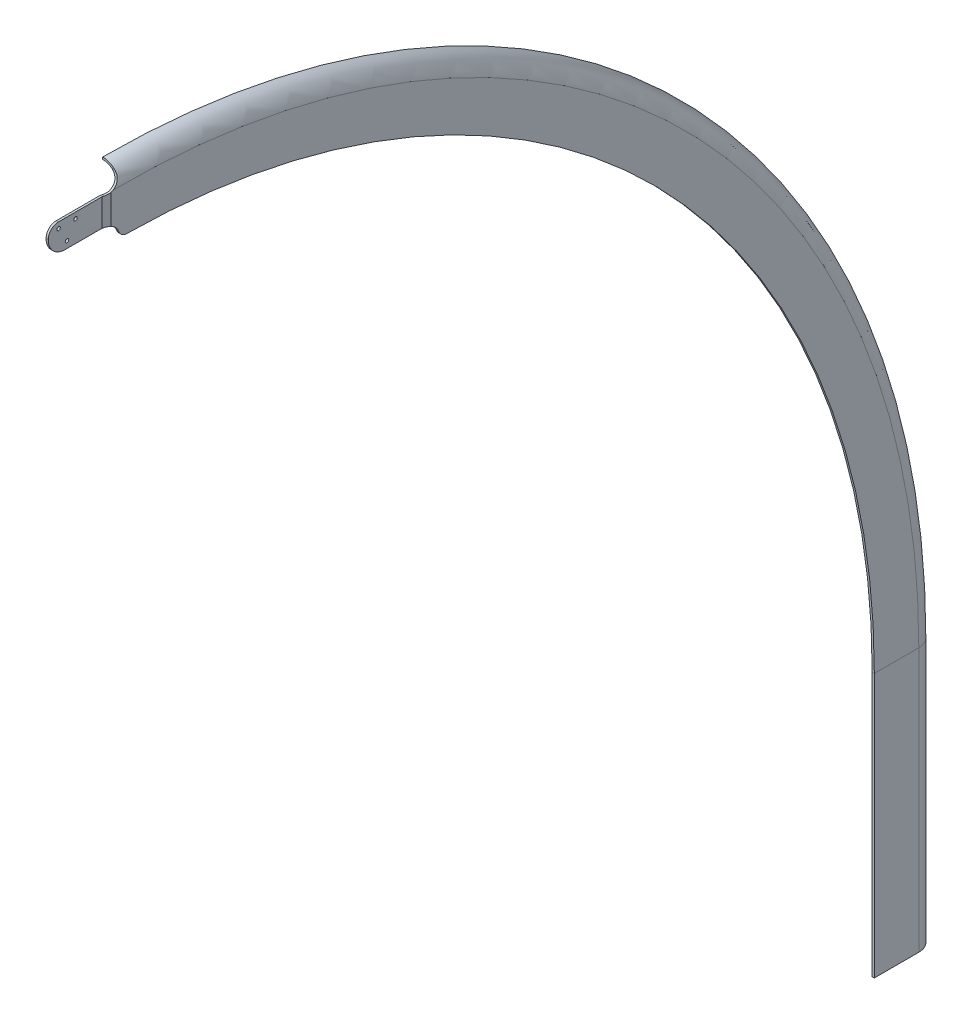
ISO-10303-21;
HEADER;
FILE_DESCRIPTION(('STEP AP214'),'2;1');
FILE_NAME('part.step','',(''),(''),'','','');
FILE_SCHEMA(('AUTOMOTIVE_DESIGN { 1 0 10303 214 1 1 1 1 }'));
ENDSEC;
DATA;
#1=APPLICATION_CONTEXT('core data for automotive mechanical design processes');
#2=APPLICATION_PROTOCOL_DEFINITION('international standard','automotive_design',2000,#1);
#3=PRODUCT_CONTEXT('',#1,'mechanical');
#4=PRODUCT('Part','Part','',(#3));
#5=PRODUCT_RELATED_PRODUCT_CATEGORY('part','',(#4));
#6=PRODUCT_DEFINITION_FORMATION('','',#4);
#7=PRODUCT_DEFINITION_CONTEXT('part definition',#1,'design');
#8=PRODUCT_DEFINITION('design','',#6,#7);
#9=PRODUCT_DEFINITION_SHAPE('','',#8);
#10=(LENGTH_UNIT() NAMED_UNIT(*) SI_UNIT(.MILLI.,.METRE.));
#11=(NAMED_UNIT(*) PLANE_ANGLE_UNIT() SI_UNIT($,.RADIAN.));
#12=(NAMED_UNIT(*) SI_UNIT($,.STERADIAN.) SOLID_ANGLE_UNIT());
#13=UNCERTAINTY_MEASURE_WITH_UNIT(LENGTH_MEASURE(1.E-05),#10,'distance_accuracy_value','');
#14=(GEOMETRIC_REPRESENTATION_CONTEXT(3) GLOBAL_UNCERTAINTY_ASSIGNED_CONTEXT((#13)) GLOBAL_UNIT_ASSIGNED_CONTEXT((#10,
#11,#12)) REPRESENTATION_CONTEXT('',''));
#15=CARTESIAN_POINT('',(0.,0.,0.));
#16=DIRECTION('',(0.,0.,1.));
#17=DIRECTION('',(1.,0.,0.));
#18=AXIS2_PLACEMENT_3D('',#15,#16,#17);
#19=CARTESIAN_POINT('',(0.,-844.7111,-645.3375));
#20=DIRECTION('',(-1.,0.,0.));
#21=DIRECTION('',(0.,0.,1.));
#22=AXIS2_PLACEMENT_3D('',#19,#20,#21);
#23=PLANE('',#22);
#24=DIRECTION('',(0.,1.,0.));
#25=VECTOR('',#24,1.);
#26=CARTESIAN_POINT('',(0.,-844.7111,-648.5125));
#27=LINE('',#26,#25);
#28=CARTESIAN_POINT('',(0.,-787.7111,-648.5125));
#29=VERTEX_POINT('',#28);
#30=CARTESIAN_POINT('',(0.,-379.5689,-648.5125));
#31=VERTEX_POINT('',#30);
#32=EDGE_CURVE('E239',#29,#31,#27,.T.);
#33=ORIENTED_EDGE('',*,*,#32,.F.);
#34=DIRECTION('',(0.,0.,-1.));
#35=VECTOR('',#34,1.);
#36=CARTESIAN_POINT('',(0.,-787.7111,-645.3375));
#37=LINE('',#36,#35);
#38=CARTESIAN_POINT('',(0.,-787.7111,-645.3375));
#39=VERTEX_POINT('',#38);
#40=EDGE_CURVE('E217',#39,#29,#37,.T.);
#41=ORIENTED_EDGE('',*,*,#40,.F.);
#42=DIRECTION('',(0.,1.,0.));
#43=VECTOR('',#42,1.);
#44=CARTESIAN_POINT('',(0.,-844.7111,-645.3375));
#45=LINE('',#44,#43);
#46=CARTESIAN_POINT('',(0.,-379.5689,-645.3375));
#47=VERTEX_POINT('',#46);
#48=EDGE_CURVE('E226',#39,#47,#45,.T.);
#49=ORIENTED_EDGE('',*,*,#48,.T.);
#50=DIRECTION('',(0.,0.,1.));
#51=VECTOR('',#50,1.);
#52=CARTESIAN_POINT('',(0.,-379.5689,-645.3375));
#53=LINE('',#52,#51);
#54=EDGE_CURVE('E340',#31,#47,#53,.T.);
#55=ORIENTED_EDGE('',*,*,#54,.F.);
#56=EDGE_LOOP('',(#33,#41,#49,#55));
#57=FACE_BOUND('',#56,.T.);
#58=ADVANCED_FACE('F50',(#57),#23,.T.);
#59=CARTESIAN_POINT('',(0.,-844.7111,-623.1125));
#60=DIRECTION('',(0.,1.,0.));
#61=DIRECTION('',(0.,0.,1.));
#62=AXIS2_PLACEMENT_3D('',#59,#60,#61);
#63=CYLINDRICAL_SURFACE('',#62,22.225);
#64=CARTESIAN_POINT('',(0.,-787.7111,-623.1125));
#65=DIRECTION('',(0.,1.,0.));
#66=DIRECTION('',(0.,0.,-1.));
#67=AXIS2_PLACEMENT_3D('',#64,#65,#66);
#68=CIRCLE('',#67,22.2249999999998);
#69=CARTESIAN_POINT('',(2.38107475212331,-787.7111,-645.209583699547));
#70=VERTEX_POINT('',#69);
#71=EDGE_CURVE('E213',#70,#39,#68,.T.);
#72=ORIENTED_EDGE('',*,*,#71,.F.);
#73=CARTESIAN_POINT('',(2.38107475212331,-787.7111,-645.209583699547));
#74=CARTESIAN_POINT('',(2.52251814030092,-787.71111617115,-645.19435608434));
#75=CARTESIAN_POINT('',(2.66380092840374,-787.705098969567,-645.177745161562));
#76=CARTESIAN_POINT('',(2.94500152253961,-787.681195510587,-645.141969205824));
#77=CARTESIAN_POINT('',(3.08491963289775,-787.663311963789,-645.12280475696));
#78=CARTESIAN_POINT('',(3.36212994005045,-787.615921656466,-645.082168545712));
#79=CARTESIAN_POINT('',(3.49942690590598,-787.586438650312,-645.060701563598));
#80=CARTESIAN_POINT('',(3.77074601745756,-787.516144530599,-645.015719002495));
#81=CARTESIAN_POINT('',(3.90476805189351,-787.475333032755,-644.992203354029));
#82=CARTESIAN_POINT('',(4.16855670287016,-787.382762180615,-644.943481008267));
#83=CARTESIAN_POINT('',(4.29832623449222,-787.331010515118,-644.918275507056));
#84=CARTESIAN_POINT('',(4.55288971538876,-787.216951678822,-644.866550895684));
#85=CARTESIAN_POINT('',(4.67768178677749,-787.154640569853,-644.840031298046));
#86=CARTESIAN_POINT('',(5.04341991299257,-786.952494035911,-644.759132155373));
#87=CARTESIAN_POINT('',(5.27584176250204,-786.797405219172,-644.703390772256));
#88=CARTESIAN_POINT('',(5.7168203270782,-786.446607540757,-644.590901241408));
#89=CARTESIAN_POINT('',(5.9246916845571,-786.250033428,-644.534160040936));
#90=CARTESIAN_POINT('',(6.20931582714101,-785.930565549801,-644.452715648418));
#91=CARTESIAN_POINT('',(6.29965848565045,-785.819977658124,-644.426179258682));
#92=CARTESIAN_POINT('',(6.47072494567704,-785.591228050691,-644.374868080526));
#93=CARTESIAN_POINT('',(6.55145167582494,-785.473068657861,-644.350092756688));
#94=CARTESIAN_POINT('',(6.71428361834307,-785.211213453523,-644.299227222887));
#95=CARTESIAN_POINT('',(6.79469314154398,-785.066384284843,-644.27352033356));
#96=CARTESIAN_POINT('',(6.94089791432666,-784.769130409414,-644.226011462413));
#97=CARTESIAN_POINT('',(7.00670935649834,-784.616714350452,-644.204205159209));
#98=CARTESIAN_POINT('',(7.06482325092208,-784.4611,-644.184730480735));
#99=B_SPLINE_CURVE_WITH_KNOTS('',3,(#73,#74,#75,#76,#77,#78,#79,#80,#81,#82,#83,#84,#85,#86,#87,
#88,#89,#90,#91,#92,#93,#94,#95,#96,#97,#98),.UNSPECIFIED.,.F.,.F.,(4,2,2,2,2,2,2,2,2,2,2,2,4),
(0.,0.426631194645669,0.853164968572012,1.27882975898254,1.70450899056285,2.12989004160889,
2.55543009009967,3.40614669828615,4.27676146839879,4.712051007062,5.1472076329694,
5.64925708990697,6.15074684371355),.UNSPECIFIED.);
#100=CARTESIAN_POINT('',(7.06482325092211,-784.4611,-644.184730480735));
#101=VERTEX_POINT('',#100);
#102=EDGE_CURVE('E76',#70,#101,#99,.T.);
#103=ORIENTED_EDGE('',*,*,#102,.T.);
#104=CARTESIAN_POINT('',(6.25,-787.7111,-644.440606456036));
#105=CARTESIAN_POINT('',(6.276241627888,-787.516042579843,-644.432913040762));
#106=CARTESIAN_POINT('',(6.30631454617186,-787.321569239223,-644.424051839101));
#107=CARTESIAN_POINT('',(6.37405971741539,-786.934075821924,-644.403889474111));
#108=CARTESIAN_POINT('',(6.41173206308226,-786.741055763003,-644.392588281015));
#109=CARTESIAN_POINT('',(6.53604447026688,-786.164646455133,-644.35487081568));
#110=CARTESIAN_POINT('',(6.63398486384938,-785.783871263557,-644.324639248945));
#111=CARTESIAN_POINT('',(6.85919344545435,-785.031806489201,-644.252888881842));
#112=CARTESIAN_POINT('',(6.98649107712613,-784.660526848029,-644.211358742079));
#113=CARTESIAN_POINT('',(7.26913274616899,-783.930482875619,-644.115656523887));
#114=CARTESIAN_POINT('',(7.42447516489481,-783.571717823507,-644.061485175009));
#115=CARTESIAN_POINT('',(7.76189541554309,-782.868706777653,-643.938826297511));
#116=CARTESIAN_POINT('',(7.94402105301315,-782.524488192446,-643.870313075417));
#117=CARTESIAN_POINT('',(8.33273349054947,-781.853839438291,-643.717348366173));
#118=CARTESIAN_POINT('',(8.5393207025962,-781.527409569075,-643.632896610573));
#119=CARTESIAN_POINT('',(8.9741282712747,-780.895189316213,-643.446498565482));
#120=CARTESIAN_POINT('',(9.20232126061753,-780.589373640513,-643.344574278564));
#121=CARTESIAN_POINT('',(9.67751511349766,-780.00014114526,-643.121626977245));
#122=CARTESIAN_POINT('',(9.92451518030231,-779.716723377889,-643.000604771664));
#123=CARTESIAN_POINT('',(10.4258523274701,-779.182604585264,-642.742304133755));
#124=CARTESIAN_POINT('',(10.6797180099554,-778.931157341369,-642.605652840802));
#125=CARTESIAN_POINT('',(11.1982981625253,-778.452219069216,-642.312433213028));
#126=CARTESIAN_POINT('',(11.46301235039,-778.224727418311,-642.155865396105));
#127=CARTESIAN_POINT('',(11.999601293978,-777.79437504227,-641.822389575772));
#128=CARTESIAN_POINT('',(12.2714768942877,-777.591517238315,-641.645479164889));
#129=CARTESIAN_POINT('',(12.8185857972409,-777.210583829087,-641.271362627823));
#130=CARTESIAN_POINT('',(13.0938191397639,-777.032508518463,-641.07415626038));
#131=CARTESIAN_POINT('',(13.6414653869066,-776.702193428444,-640.661786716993));
#132=CARTESIAN_POINT('',(13.9138811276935,-776.549732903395,-640.44680364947));
#133=CARTESIAN_POINT('',(14.4550883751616,-776.267719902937,-639.998133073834));
#134=CARTESIAN_POINT('',(14.7238799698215,-776.138166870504,-639.764446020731));
#135=CARTESIAN_POINT('',(15.2550031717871,-775.900502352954,-639.279284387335));
#136=CARTESIAN_POINT('',(15.517331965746,-775.792400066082,-639.027802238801));
#137=CARTESIAN_POINT('',(16.0328943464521,-775.595949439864,-638.508309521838));
#138=CARTESIAN_POINT('',(16.2861261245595,-775.507605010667,-638.240295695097));
#139=CARTESIAN_POINT('',(16.873314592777,-775.319219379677,-637.586609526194));
#140=CARTESIAN_POINT('',(17.2023260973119,-775.227018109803,-637.194205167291));
#141=CARTESIAN_POINT('',(17.8348636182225,-775.070746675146,-636.384000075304));
#142=CARTESIAN_POINT('',(18.1383796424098,-775.006687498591,-635.966189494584));
#143=CARTESIAN_POINT('',(18.7170544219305,-774.901260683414,-635.107944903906));
#144=CARTESIAN_POINT('',(18.9921774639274,-774.859921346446,-634.667483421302));
#145=CARTESIAN_POINT('',(19.5112646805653,-774.794900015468,-633.767591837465));
#146=CARTESIAN_POINT('',(19.7552393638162,-774.771212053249,-633.308168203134));
#147=CARTESIAN_POINT('',(20.2034751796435,-774.737252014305,-632.387422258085));
#148=CARTESIAN_POINT('',(20.4087320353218,-774.72658726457,-631.926599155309));
#149=CARTESIAN_POINT('',(20.692349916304,-774.716789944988,-631.226706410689));
#150=CARTESIAN_POINT('',(20.7826831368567,-774.714555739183,-630.992457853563));
#151=CARTESIAN_POINT('',(20.9553805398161,-774.711713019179,-630.520986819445));
#152=CARTESIAN_POINT('',(21.0377433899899,-774.711104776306,-630.283763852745));
#153=CARTESIAN_POINT('',(21.1160687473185,-774.7111,-630.04519541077));
#154=B_SPLINE_CURVE_WITH_KNOTS('',3,(#104,#105,#106,#107,#108,#109,#110,#111,#112,#113,#114,
#115,#116,#117,#118,#119,#120,#121,#122,#123,#124,#125,#126,#127,#128,#129,#130,#131,#132,#133,
#134,#135,#136,#137,#138,#139,#140,#141,#142,#143,#144,#145,#146,#147,#148,#149,#150,#151,#152,
#153),.UNSPECIFIED.,.F.,.F.,(4,2,2,2,2,2,2,2,2,2,2,2,2,2,2,2,2,2,2,2,2,2,2,2,4),(0.,
0.590808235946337,1.18162367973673,2.36314339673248,3.54585330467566,4.72849497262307,
5.91327375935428,7.09807250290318,8.28139008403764,9.46465756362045,10.6109009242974,
11.7571144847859,12.9034638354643,14.0498268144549,15.1857381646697,16.3216218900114,
17.4579916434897,18.5945860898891,20.1532708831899,21.7125637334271,23.2737945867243,
24.8344973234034,26.3468777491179,27.0999675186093,27.8531829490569),.UNSPECIFIED.);
#155=CARTESIAN_POINT('',(21.1160687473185,-774.7111,-630.04519541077));
#156=VERTEX_POINT('',#155);
#157=EDGE_CURVE('E511',#101,#156,#154,.T.);
#158=ORIENTED_EDGE('',*,*,#157,.T.);
#159=CARTESIAN_POINT('',(0.,-774.7111,-623.1125));
#160=DIRECTION('',(0.,-1.,0.));
#161=DIRECTION('',(0.,0.,-1.));
#162=AXIS2_PLACEMENT_3D('',#159,#160,#161);
#163=CIRCLE('',#162,22.225);
#164=CARTESIAN_POINT('',(22.225,-774.7111,-623.1125));
#165=VERTEX_POINT('',#164);
#166=EDGE_CURVE('E255',#156,#165,#163,.T.);
#167=ORIENTED_EDGE('',*,*,#166,.T.);
#168=DIRECTION('',(0.,1.,0.));
#169=VECTOR('',#168,1.);
#170=CARTESIAN_POINT('',(22.225,-844.7111,-623.1125));
#171=LINE('',#170,#169);
#172=CARTESIAN_POINT('',(22.225,-379.5689,-623.1125));
#173=VERTEX_POINT('',#172);
#174=EDGE_CURVE('E322',#165,#173,#171,.T.);
#175=ORIENTED_EDGE('',*,*,#174,.T.);
#176=CARTESIAN_POINT('',(0.,-379.5689,-623.1125));
#177=DIRECTION('',(0.,-1.,0.));
#178=DIRECTION('',(0.,0.,-1.));
#179=AXIS2_PLACEMENT_3D('',#176,#177,#178);
#180=CIRCLE('',#179,22.225);
#181=EDGE_CURVE('E228',#47,#173,#180,.T.);
#182=ORIENTED_EDGE('',*,*,#181,.F.);
#183=ORIENTED_EDGE('',*,*,#48,.F.);
#184=EDGE_LOOP('',(#72,#103,#158,#167,#175,#182,#183));
#185=FACE_BOUND('',#184,.T.);
#186=ADVANCED_FACE('F227',(#185),#63,.F.);
#187=CARTESIAN_POINT('',(22.225,-844.7111,-623.1125));
#188=DIRECTION('',(-1.,0.,0.));
#189=DIRECTION('',(0.,0.,1.));
#190=AXIS2_PLACEMENT_3D('',#187,#188,#189);
#191=PLANE('',#190);
#192=ORIENTED_EDGE('',*,*,#174,.F.);
#193=DIRECTION('',(0.,0.,1.));
#194=VECTOR('',#193,1.);
#195=CARTESIAN_POINT('',(22.225,-774.7111,-623.1125));
#196=LINE('',#195,#194);
#197=CARTESIAN_POINT('',(22.225,-774.7111,-556.4375));
#198=VERTEX_POINT('',#197);
#199=EDGE_CURVE('E251',#165,#198,#196,.T.);
#200=ORIENTED_EDGE('',*,*,#199,.T.);
#201=DIRECTION('',(0.,1.,0.));
#202=VECTOR('',#201,1.);
#203=CARTESIAN_POINT('',(22.225,-844.7111,-556.4375));
#204=LINE('',#203,#202);
#205=CARTESIAN_POINT('',(22.225,-379.5689,-556.4375));
#206=VERTEX_POINT('',#205);
#207=EDGE_CURVE('E341',#198,#206,#204,.T.);
#208=ORIENTED_EDGE('',*,*,#207,.T.);
#209=DIRECTION('',(0.,0.,1.));
#210=VECTOR('',#209,1.);
#211=CARTESIAN_POINT('',(22.225,-379.5689,-623.1125));
#212=LINE('',#211,#210);
#213=EDGE_CURVE('E325',#173,#206,#212,.T.);
#214=ORIENTED_EDGE('',*,*,#213,.F.);
#215=EDGE_LOOP('',(#192,#200,#208,#214));
#216=FACE_BOUND('',#215,.T.);
#217=ADVANCED_FACE('F474',(#216),#191,.T.);
#218=CARTESIAN_POINT('',(22.225,-844.7111,-556.4375));
#219=DIRECTION('',(0.,0.,1.));
#220=DIRECTION('',(0.,-1.,0.));
#221=AXIS2_PLACEMENT_3D('',#218,#219,#220);
#222=PLANE('',#221);
#223=ORIENTED_EDGE('',*,*,#207,.F.);
#224=DIRECTION('',(1.,0.,0.));
#225=VECTOR('',#224,1.);
#226=CARTESIAN_POINT('',(22.225,-774.7111,-556.4375));
#227=LINE('',#226,#225);
#228=CARTESIAN_POINT('',(25.4,-774.7111,-556.4375));
#229=VERTEX_POINT('',#228);
#230=EDGE_CURVE('E249',#198,#229,#227,.T.);
#231=ORIENTED_EDGE('',*,*,#230,.T.);
#232=DIRECTION('',(0.,1.,0.));
#233=VECTOR('',#232,1.);
#234=CARTESIAN_POINT('',(25.4,-844.7111,-556.4375));
#235=LINE('',#234,#233);
#236=CARTESIAN_POINT('',(25.4,-379.5689,-556.4375));
#237=VERTEX_POINT('',#236);
#238=EDGE_CURVE('E355',#229,#237,#235,.T.);
#239=ORIENTED_EDGE('',*,*,#238,.T.);
#240=DIRECTION('',(1.,0.,0.));
#241=VECTOR('',#240,1.);
#242=CARTESIAN_POINT('',(22.225,-379.5689,-556.4375));
#243=LINE('',#242,#241);
#244=EDGE_CURVE('E342',#206,#237,#243,.T.);
#245=ORIENTED_EDGE('',*,*,#244,.F.);
#246=EDGE_LOOP('',(#223,#231,#239,#245));
#247=FACE_BOUND('',#246,.T.);
#248=ADVANCED_FACE('F473',(#247),#222,.T.);
#249=CARTESIAN_POINT('',(25.4,-844.7111,-623.1125));
#250=DIRECTION('',(1.,0.,0.));
#251=DIRECTION('',(0.,0.,-1.));
#252=AXIS2_PLACEMENT_3D('',#249,#250,#251);
#253=PLANE('',#252);
#254=ORIENTED_EDGE('',*,*,#238,.F.);
#255=DIRECTION('',(0.,0.,-1.));
#256=VECTOR('',#255,1.);
#257=CARTESIAN_POINT('',(25.4,-774.7111,-623.1125));
#258=LINE('',#257,#256);
#259=CARTESIAN_POINT('',(25.4,-774.7111,-623.1125));
#260=VERTEX_POINT('',#259);
#261=EDGE_CURVE('E241',#229,#260,#258,.T.);
#262=ORIENTED_EDGE('',*,*,#261,.T.);
#263=DIRECTION('',(0.,1.,0.));
#264=VECTOR('',#263,1.);
#265=CARTESIAN_POINT('',(25.4,-844.7111,-623.1125));
#266=LINE('',#265,#264);
#267=CARTESIAN_POINT('',(25.4,-379.5689,-623.1125));
#268=VERTEX_POINT('',#267);
#269=EDGE_CURVE('E365',#260,#268,#266,.T.);
#270=ORIENTED_EDGE('',*,*,#269,.T.);
#271=DIRECTION('',(0.,0.,-1.));
#272=VECTOR('',#271,1.);
#273=CARTESIAN_POINT('',(25.4,-379.5689,-623.1125));
#274=LINE('',#273,#272);
#275=EDGE_CURVE('E354',#237,#268,#274,.T.);
#276=ORIENTED_EDGE('',*,*,#275,.F.);
#277=EDGE_LOOP('',(#254,#262,#270,#276));
#278=FACE_BOUND('',#277,.T.);
#279=ADVANCED_FACE('F484',(#278),#253,.T.);
#280=CARTESIAN_POINT('',(0.,-844.7111,-623.1125));
#281=DIRECTION('',(0.,1.,0.));
#282=DIRECTION('',(0.,0.,1.));
#283=AXIS2_PLACEMENT_3D('',#280,#281,#282);
#284=CYLINDRICAL_SURFACE('',#283,25.4);
#285=CARTESIAN_POINT('',(21.1160687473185,-774.7111,-637.228860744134));
#286=CARTESIAN_POINT('',(20.9683340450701,-774.711103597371,-637.449851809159));
#287=CARTESIAN_POINT('',(20.8171384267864,-774.713282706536,-637.66850764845));
#288=CARTESIAN_POINT('',(20.5079926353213,-774.722631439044,-638.100925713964));
#289=CARTESIAN_POINT('',(20.3500415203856,-774.729801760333,-638.314687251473));
#290=CARTESIAN_POINT('',(19.8659220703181,-774.75978597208,-638.948789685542));
#291=CARTESIAN_POINT('',(19.5298986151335,-774.79107667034,-639.361333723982));
#292=CARTESIAN_POINT('',(18.8319795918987,-774.881819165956,-640.165412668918));
#293=CARTESIAN_POINT('',(18.4699305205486,-774.941452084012,-640.556794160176));
#294=CARTESIAN_POINT('',(17.7256428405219,-775.094358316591,-641.312566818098));
#295=CARTESIAN_POINT('',(17.3434186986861,-775.187607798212,-641.676976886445));
#296=CARTESIAN_POINT('',(16.6457473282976,-775.389129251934,-642.302343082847));
#297=CARTESIAN_POINT('',(16.3332078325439,-775.490091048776,-642.568914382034));
#298=CARTESIAN_POINT('',(15.7014666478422,-775.718428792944,-643.082214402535));
#299=CARTESIAN_POINT('',(15.3822650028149,-775.845804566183,-643.32894325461));
#300=CARTESIAN_POINT('',(14.7418309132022,-776.128347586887,-643.800565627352));
#301=CARTESIAN_POINT('',(14.420608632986,-776.283421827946,-644.025528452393));
#302=CARTESIAN_POINT('',(13.7791050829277,-776.6229134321,-644.453656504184));
#303=CARTESIAN_POINT('',(13.458823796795,-776.807330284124,-644.65682211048));
#304=CARTESIAN_POINT('',(12.8216116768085,-777.207327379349,-645.042063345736));
#305=CARTESIAN_POINT('',(12.5047133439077,-777.423091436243,-645.224002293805));
#306=CARTESIAN_POINT('',(11.8808790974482,-777.884780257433,-645.565365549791));
#307=CARTESIAN_POINT('',(11.5739434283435,-778.130705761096,-645.724789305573));
#308=CARTESIAN_POINT('',(10.9743486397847,-778.652010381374,-646.021793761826));
#309=CARTESIAN_POINT('',(10.6817017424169,-778.927414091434,-646.159355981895));
#310=CARTESIAN_POINT('',(10.1152796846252,-779.505882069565,-646.4135195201));
#311=CARTESIAN_POINT('',(9.84150326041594,-779.808944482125,-646.530122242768));
#312=CARTESIAN_POINT('',(9.33851249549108,-780.414275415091,-646.734940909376));
#313=CARTESIAN_POINT('',(9.10748562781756,-780.714517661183,-646.824710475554));
#314=CARTESIAN_POINT('',(8.66714624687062,-781.334414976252,-646.989179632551));
#315=CARTESIAN_POINT('',(8.45783312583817,-781.654069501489,-647.063879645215));
#316=CARTESIAN_POINT('',(8.06315536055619,-782.310549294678,-647.199614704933));
#317=CARTESIAN_POINT('',(7.87778899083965,-782.647373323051,-647.260650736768));
#318=CARTESIAN_POINT('',(7.53282689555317,-783.335854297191,-647.370474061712));
#319=CARTESIAN_POINT('',(7.37322855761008,-783.687509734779,-647.419262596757));
#320=CARTESIAN_POINT('',(7.10784215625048,-784.338058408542,-647.498030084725));
#321=CARTESIAN_POINT('',(6.9975470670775,-784.634907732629,-647.529816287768));
#322=CARTESIAN_POINT('',(6.79581350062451,-785.235540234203,-647.586729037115));
#323=CARTESIAN_POINT('',(6.70437272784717,-785.539322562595,-647.611856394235));
#324=CARTESIAN_POINT('',(6.54096207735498,-786.152077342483,-647.655993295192));
#325=CARTESIAN_POINT('',(6.46896660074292,-786.461042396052,-647.675010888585));
#326=CARTESIAN_POINT('',(6.3446405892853,-787.083226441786,-647.707404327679));
#327=CARTESIAN_POINT('',(6.29231188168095,-787.39644582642,-647.720779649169));
#328=CARTESIAN_POINT('',(6.25,-787.7111,-647.731547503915));
#329=B_SPLINE_CURVE_WITH_KNOTS('',3,(#285,#286,#287,#288,#289,#290,#291,#292,#293,#294,#295,
#296,#297,#298,#299,#300,#301,#302,#303,#304,#305,#306,#307,#308,#309,#310,#311,#312,#313,#314,
#315,#316,#317,#318,#319,#320,#321,#322,#323,#324,#325,#326,#327,#328),.UNSPECIFIED.,.F.,.F.,(4,
2,2,2,2,2,2,2,2,2,2,2,2,2,2,2,2,2,2,2,2,4),(0.,0.797389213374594,1.59488995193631,
3.19210418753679,4.79966553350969,6.40608941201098,7.67388680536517,8.941675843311,
10.2052852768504,11.4688727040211,12.7401933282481,14.0115451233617,15.2839659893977,
16.5563015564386,17.7229210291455,18.8895078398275,20.0560105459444,21.2223949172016,
22.1765221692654,23.1305331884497,24.0832821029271,25.0361195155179),.UNSPECIFIED.);
#330=CARTESIAN_POINT('',(21.1160687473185,-774.7111,-637.228860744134));
#331=VERTEX_POINT('',#330);
#332=CARTESIAN_POINT('',(7.06482325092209,-784.4611,-647.510210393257));
#333=VERTEX_POINT('',#332);
#334=EDGE_CURVE('E503',#331,#333,#329,.T.);
#335=ORIENTED_EDGE('',*,*,#334,.T.);
#336=CARTESIAN_POINT('',(7.0648232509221,-784.4611,-647.510210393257));
#337=CARTESIAN_POINT('',(7.0152987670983,-784.59369074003,-647.524546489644));
#338=CARTESIAN_POINT('',(6.96017502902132,-784.724014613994,-647.540349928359));
#339=CARTESIAN_POINT('',(6.83926404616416,-784.979236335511,-647.574480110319));
#340=CARTESIAN_POINT('',(6.77347944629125,-785.104135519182,-647.592806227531));
#341=CARTESIAN_POINT('',(6.63186405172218,-785.347497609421,-647.631548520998));
#342=CARTESIAN_POINT('',(6.55604862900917,-785.465969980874,-647.651961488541));
#343=CARTESIAN_POINT('',(6.39487149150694,-785.695919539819,-647.694456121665));
#344=CARTESIAN_POINT('',(6.3095093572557,-785.807396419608,-647.716537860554));
#345=CARTESIAN_POINT('',(6.1299208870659,-786.022561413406,-647.761894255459));
#346=CARTESIAN_POINT('',(6.03570100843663,-786.126255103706,-647.785168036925));
#347=CARTESIAN_POINT('',(5.83895858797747,-786.325326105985,-647.832467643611));
#348=CARTESIAN_POINT('',(5.73643319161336,-786.420700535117,-647.856493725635));
#349=CARTESIAN_POINT('',(5.52376695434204,-786.602508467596,-647.90483529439));
#350=CARTESIAN_POINT('',(5.41362458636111,-786.688940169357,-647.92915083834));
#351=CARTESIAN_POINT('',(5.18645870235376,-786.852282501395,-647.977618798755));
#352=CARTESIAN_POINT('',(5.0694351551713,-786.929193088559,-648.001771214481));
#353=CARTESIAN_POINT('',(4.82700962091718,-787.074324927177,-648.049932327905));
#354=CARTESIAN_POINT('',(4.70149177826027,-787.142356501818,-648.073929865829));
#355=CARTESIAN_POINT('',(4.44498610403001,-787.26748304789,-648.120880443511));
#356=CARTESIAN_POINT('',(4.31400019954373,-787.324581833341,-648.143833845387));
#357=CARTESIAN_POINT('',(4.04748702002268,-787.427396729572,-648.188306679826));
#358=CARTESIAN_POINT('',(3.91196249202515,-787.473119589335,-648.20982695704));
#359=CARTESIAN_POINT('',(3.63729582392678,-787.55283095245,-648.251103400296));
#360=CARTESIAN_POINT('',(3.49815487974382,-787.586823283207,-648.270860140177));
#361=CARTESIAN_POINT('',(3.19723601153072,-787.64674684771,-648.310987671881));
#362=CARTESIAN_POINT('',(3.03504854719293,-787.670848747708,-648.331047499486));
#363=CARTESIAN_POINT('',(2.70898362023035,-787.703029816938,-648.368164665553));
#364=CARTESIAN_POINT('',(2.54510879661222,-787.711131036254,-648.385226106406));
#365=CARTESIAN_POINT('',(2.38107475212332,-787.7111,-648.400649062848));
#366=B_SPLINE_CURVE_WITH_KNOTS('',3,(#336,#337,#338,#339,#340,#341,#342,#343,#344,#345,#346,
#347,#348,#349,#350,#351,#352,#353,#354,#355,#356,#357,#358,#359,#360,#361,#362,#363,#364,#365),
.UNSPECIFIED.,.F.,.F.,(4,2,2,2,2,2,2,2,2,2,2,2,2,2,4),(0.,0.426629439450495,0.853153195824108,
1.2790307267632,1.70492697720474,2.13051512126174,2.5562501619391,2.9820708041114,
3.40789337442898,3.84168955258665,4.27533411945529,4.70872080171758,5.14196594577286,
5.6367132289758,6.1307782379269),.UNSPECIFIED.);
#367=CARTESIAN_POINT('',(2.38107475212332,-787.7111,-648.400649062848));
#368=VERTEX_POINT('',#367);
#369=EDGE_CURVE('E11',#333,#368,#366,.T.);
#370=ORIENTED_EDGE('',*,*,#369,.T.);
#371=CARTESIAN_POINT('',(0.,-787.7111,-623.1125));
#372=DIRECTION('',(0.,-1.,0.));
#373=DIRECTION('',(0.,0.,-1.));
#374=AXIS2_PLACEMENT_3D('',#371,#372,#373);
#375=CIRCLE('',#374,25.4);
#376=EDGE_CURVE('E240',#29,#368,#375,.T.);
#377=ORIENTED_EDGE('',*,*,#376,.F.);
#378=ORIENTED_EDGE('',*,*,#32,.T.);
#379=CARTESIAN_POINT('',(0.,-379.5689,-623.1125));
#380=DIRECTION('',(0.,1.,0.));
#381=DIRECTION('',(0.,0.,-1.));
#382=AXIS2_PLACEMENT_3D('',#379,#380,#381);
#383=CIRCLE('',#382,25.4);
#384=EDGE_CURVE('E366',#268,#31,#383,.T.);
#385=ORIENTED_EDGE('',*,*,#384,.F.);
#386=ORIENTED_EDGE('',*,*,#269,.F.);
#387=CARTESIAN_POINT('',(0.,-774.7111,-623.1125));
#388=DIRECTION('',(0.,-1.,0.));
#389=DIRECTION('',(0.,0.,-1.));
#390=AXIS2_PLACEMENT_3D('',#387,#388,#389);
#391=CIRCLE('',#390,25.4);
#392=EDGE_CURVE('E602',#260,#331,#391,.F.);
#393=ORIENTED_EDGE('',*,*,#392,.T.);
#394=EDGE_LOOP('',(#335,#370,#377,#378,#385,#386,#393));
#395=FACE_BOUND('',#394,.T.);
#396=ADVANCED_FACE('F483',(#395),#284,.T.);
#397=CARTESIAN_POINT('',(22.225,-379.5689,-623.1125));
#398=DIRECTION('',(-1.,0.,0.));
#399=DIRECTION('',(0.,0.,1.));
#400=AXIS2_PLACEMENT_3D('',#397,#398,#399);
#401=PLANE('',#400);
#402=CARTESIAN_POINT('',(22.225,-379.5689,574.18));
#403=DIRECTION('',(1.,0.,0.));
#404=DIRECTION('',(0.,0.,-1.));
#405=AXIS2_PLACEMENT_3D('',#402,#403,#404);
#406=CIRCLE('',#405,1130.6175);
#407=CARTESIAN_POINT('',(22.225,750.996154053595,563.290102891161));
#408=VERTEX_POINT('',#407);
#409=EDGE_CURVE('E331',#206,#408,#406,.T.);
#410=ORIENTED_EDGE('',*,*,#409,.T.);
#411=CARTESIAN_POINT('',(22.225,763.995551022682,563.164889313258));
#412=DIRECTION('',(-1.,0.,0.));
#413=DIRECTION('',(0.,0.,1.));
#414=AXIS2_PLACEMENT_3D('',#411,#412,#413);
#415=CIRCLE('',#414,13.);
#416=CARTESIAN_POINT('',(22.225,759.618775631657,575.405961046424));
#417=VERTEX_POINT('',#416);
#418=EDGE_CURVE('E596',#408,#417,#415,.T.);
#419=ORIENTED_EDGE('',*,*,#418,.T.);
#420=CARTESIAN_POINT('',(22.225,752.5486,595.18));
#421=DIRECTION('',(-1.,0.,0.));
#422=DIRECTION('',(0.,0.,1.));
#423=AXIS2_PLACEMENT_3D('',#420,#421,#422);
#424=CIRCLE('',#423,21.);
#425=CARTESIAN_POINT('',(22.225,771.787553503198,586.762003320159));
#426=VERTEX_POINT('',#425);
#427=EDGE_CURVE('E586',#417,#426,#424,.F.);
#428=ORIENTED_EDGE('',*,*,#427,.T.);
#429=DIRECTION('',(0.,-1.,0.));
#430=VECTOR('',#429,1.);
#431=CARTESIAN_POINT('',(22.225,814.5486,586.762003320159));
#432=LINE('',#431,#430);
#433=CARTESIAN_POINT('',(22.225,816.309646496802,586.762003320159));
#434=VERTEX_POINT('',#433);
#435=EDGE_CURVE('E234',#434,#426,#432,.T.);
#436=ORIENTED_EDGE('',*,*,#435,.F.);
#437=CARTESIAN_POINT('',(22.225,835.5486,595.18));
#438=DIRECTION('',(-1.,0.,0.));
#439=DIRECTION('',(0.,0.,1.));
#440=AXIS2_PLACEMENT_3D('',#437,#438,#439);
#441=CIRCLE('',#440,21.);
#442=CARTESIAN_POINT('',(22.225,817.68213709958,584.144171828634));
#443=VERTEX_POINT('',#442);
#444=EDGE_CURVE('E436',#434,#443,#441,.F.);
#445=ORIENTED_EDGE('',*,*,#444,.T.);
#446=CARTESIAN_POINT('',(22.225,-379.5689,574.18));
#447=DIRECTION('',(1.,0.,0.));
#448=DIRECTION('',(0.,0.,-1.));
#449=AXIS2_PLACEMENT_3D('',#446,#447,#448);
#450=CIRCLE('',#449,1197.2925);
#451=EDGE_CURVE('E328',#173,#443,#450,.T.);
#452=ORIENTED_EDGE('',*,*,#451,.F.);
#453=ORIENTED_EDGE('',*,*,#213,.T.);
#454=EDGE_LOOP('',(#410,#419,#428,#436,#445,#452,#453));
#455=FACE_BOUND('',#454,.T.);
#456=ADVANCED_FACE('F477',(#455),#401,.T.);
#457=CARTESIAN_POINT('',(22.225,814.5486,586.762003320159));
#458=DIRECTION('',(0.965925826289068,0.,0.258819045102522));
#459=DIRECTION('',(0.258819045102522,0.,-0.965925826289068));
#460=AXIS2_PLACEMENT_3D('',#457,#458,#459);
#461=PLANE('',#460);
#462=DIRECTION('',(0.258819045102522,0.,-0.965925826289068));
#463=VECTOR('',#462,1.);
#464=CARTESIAN_POINT('',(22.225,773.5486,586.762003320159));
#465=LINE('',#464,#463);
#466=CARTESIAN_POINT('',(19.3785501,773.5486,597.385098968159));
#467=VERTEX_POINT('',#466);
#468=CARTESIAN_POINT('',(19.9694045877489,773.5486,595.18));
#469=VERTEX_POINT('',#468);
#470=EDGE_CURVE('E278',#467,#469,#465,.T.);
#471=ORIENTED_EDGE('',*,*,#470,.F.);
#472=DIRECTION('',(0.,-1.,0.));
#473=VECTOR('',#472,1.);
#474=CARTESIAN_POINT('',(19.3785501,814.5486,597.385098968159));
#475=LINE('',#474,#473);
#476=CARTESIAN_POINT('',(19.3785501,814.5486,597.385098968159));
#477=VERTEX_POINT('',#476);
#478=EDGE_CURVE('E311',#477,#467,#475,.T.);
#479=ORIENTED_EDGE('',*,*,#478,.F.);
#480=DIRECTION('',(-0.258819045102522,0.,0.965925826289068));
#481=VECTOR('',#480,1.);
#482=CARTESIAN_POINT('',(22.225,814.5486,586.762003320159));
#483=LINE('',#482,#481);
#484=CARTESIAN_POINT('',(19.969404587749,814.5486,595.18));
#485=VERTEX_POINT('',#484);
#486=EDGE_CURVE('E284',#485,#477,#483,.T.);
#487=ORIENTED_EDGE('',*,*,#486,.F.);
#488=CARTESIAN_POINT('',(19.969404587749,835.5486,595.18));
#489=DIRECTION('',(0.965925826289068,0.,0.258819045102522));
#490=DIRECTION('',(0.258819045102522,0.,-0.965925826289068));
#491=AXIS2_PLACEMENT_3D('',#488,#489,#490);
#492=ELLIPSE('',#491,21.7407997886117,21.);
#493=EDGE_CURVE('E434',#485,#434,#492,.T.);
#494=ORIENTED_EDGE('',*,*,#493,.T.);
#495=ORIENTED_EDGE('',*,*,#435,.T.);
#496=CARTESIAN_POINT('',(19.9694045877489,752.5486,595.18));
#497=DIRECTION('',(0.965925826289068,0.,0.258819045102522));
#498=DIRECTION('',(0.258819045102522,0.,-0.965925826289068));
#499=AXIS2_PLACEMENT_3D('',#496,#497,#498);
#500=ELLIPSE('',#499,21.7407997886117,21.);
#501=EDGE_CURVE('E582',#426,#469,#500,.T.);
#502=ORIENTED_EDGE('',*,*,#501,.T.);
#503=EDGE_LOOP('',(#471,#479,#487,#494,#495,#502));
#504=FACE_BOUND('',#503,.T.);
#505=ADVANCED_FACE('F480',(#504),#461,.F.);
#506=CARTESIAN_POINT('',(19.3785501,814.5486,597.385098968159));
#507=DIRECTION('',(1.,0.,0.));
#508=DIRECTION('',(0.,0.,-1.));
#509=AXIS2_PLACEMENT_3D('',#506,#507,#508);
#510=PLANE('',#509);
#511=CARTESIAN_POINT('',(19.3785501,805.7236,662.800000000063));
#512=DIRECTION('',(-1.,0.,0.));
#513=DIRECTION('',(0.,0.,1.));
#514=AXIS2_PLACEMENT_3D('',#511,#512,#513);
#515=CIRCLE('',#514,2.59080000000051);
#516=CARTESIAN_POINT('',(19.3785501,805.7236,665.390800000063));
#517=VERTEX_POINT('',#516);
#518=EDGE_CURVE('E260',#517,#517,#515,.T.);
#519=ORIENTED_EDGE('',*,*,#518,.F.);
#520=EDGE_LOOP('',(#519));
#521=FACE_BOUND('',#520,.T.);
#522=CARTESIAN_POINT('',(19.3785501,805.7236,637.400000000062));
#523=DIRECTION('',(-1.,0.,0.));
#524=DIRECTION('',(0.,0.,1.));
#525=AXIS2_PLACEMENT_3D('',#522,#523,#524);
#526=CIRCLE('',#525,2.59079999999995);
#527=CARTESIAN_POINT('',(19.3785501,805.7236,639.990800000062));
#528=VERTEX_POINT('',#527);
#529=EDGE_CURVE('E264',#528,#528,#526,.T.);
#530=ORIENTED_EDGE('',*,*,#529,.F.);
#531=EDGE_LOOP('',(#530));
#532=FACE_BOUND('',#531,.T.);
#533=CARTESIAN_POINT('',(19.3785501,783.726554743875,650.100000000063));
#534=DIRECTION('',(-1.,0.,0.));
#535=DIRECTION('',(0.,0.,1.));
#536=AXIS2_PLACEMENT_3D('',#533,#534,#535);
#537=CIRCLE('',#536,2.59079999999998);
#538=CARTESIAN_POINT('',(19.3785501,783.726554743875,652.690800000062));
#539=VERTEX_POINT('',#538);
#540=EDGE_CURVE('E256',#539,#539,#537,.T.);
#541=ORIENTED_EDGE('',*,*,#540,.F.);
#542=EDGE_LOOP('',(#541));
#543=FACE_BOUND('',#542,.T.);
#544=DIRECTION('',(0.,0.,-1.));
#545=VECTOR('',#544,1.);
#546=CARTESIAN_POINT('',(19.3785501,773.5486,597.385098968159));
#547=LINE('',#546,#545);
#548=CARTESIAN_POINT('',(19.3785501,773.5486,653.248326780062));
#549=VERTEX_POINT('',#548);
#550=EDGE_CURVE('E274',#549,#467,#547,.T.);
#551=ORIENTED_EDGE('',*,*,#550,.F.);
#552=CARTESIAN_POINT('',(19.3785501,798.5486,653.248326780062));
#553=DIRECTION('',(1.,0.,0.));
#554=DIRECTION('',(0.,0.,-1.));
#555=AXIS2_PLACEMENT_3D('',#552,#553,#554);
#556=CIRCLE('',#555,25.);
#557=CARTESIAN_POINT('',(19.3785501,798.5486,678.248326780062));
#558=VERTEX_POINT('',#557);
#559=EDGE_CURVE('E420',#549,#558,#556,.F.);
#560=ORIENTED_EDGE('',*,*,#559,.T.);
#561=DIRECTION('',(0.,-1.,0.));
#562=VECTOR('',#561,1.);
#563=CARTESIAN_POINT('',(19.3785501,814.5486,678.248326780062));
#564=LINE('',#563,#562);
#565=CARTESIAN_POINT('',(19.3785501,799.5486,678.248326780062));
#566=VERTEX_POINT('',#565);
#567=EDGE_CURVE('E306',#566,#558,#564,.T.);
#568=ORIENTED_EDGE('',*,*,#567,.F.);
#569=CARTESIAN_POINT('',(19.3785501,799.5486,663.248326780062));
#570=DIRECTION('',(1.,0.,0.));
#571=DIRECTION('',(0.,0.,-1.));
#572=AXIS2_PLACEMENT_3D('',#569,#570,#571);
#573=CIRCLE('',#572,15.);
#574=CARTESIAN_POINT('',(19.3785501,814.5486,663.248326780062));
#575=VERTEX_POINT('',#574);
#576=EDGE_CURVE('E409',#566,#575,#573,.F.);
#577=ORIENTED_EDGE('',*,*,#576,.T.);
#578=DIRECTION('',(0.,0.,1.));
#579=VECTOR('',#578,1.);
#580=CARTESIAN_POINT('',(19.3785501,814.5486,597.385098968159));
#581=LINE('',#580,#579);
#582=EDGE_CURVE('E289',#477,#575,#581,.T.);
#583=ORIENTED_EDGE('',*,*,#582,.F.);
#584=ORIENTED_EDGE('',*,*,#478,.T.);
#585=EDGE_LOOP('',(#551,#560,#568,#577,#583,#584));
#586=FACE_BOUND('',#585,.T.);
#587=ADVANCED_FACE('F758',(#521,#532,#543,#586),#510,.F.);
#588=CARTESIAN_POINT('',(22.5535501,814.5486,678.248326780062));
#589=DIRECTION('',(0.,0.,-1.));
#590=DIRECTION('',(-1.,0.,0.));
#591=AXIS2_PLACEMENT_3D('',#588,#589,#590);
#592=PLANE('',#591);
#593=ORIENTED_EDGE('',*,*,#567,.T.);
#594=DIRECTION('',(-1.,0.,0.));
#595=VECTOR('',#594,1.);
#596=CARTESIAN_POINT('',(22.5535501,798.5486,678.248326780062));
#597=LINE('',#596,#595);
#598=CARTESIAN_POINT('',(22.5535501,798.5486,678.248326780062));
#599=VERTEX_POINT('',#598);
#600=EDGE_CURVE('E419',#558,#599,#597,.F.);
#601=ORIENTED_EDGE('',*,*,#600,.T.);
#602=DIRECTION('',(0.,-1.,0.));
#603=VECTOR('',#602,1.);
#604=CARTESIAN_POINT('',(22.5535501,814.5486,678.248326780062));
#605=LINE('',#604,#603);
#606=CARTESIAN_POINT('',(22.5535501,799.5486,678.248326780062));
#607=VERTEX_POINT('',#606);
#608=EDGE_CURVE('E303',#607,#599,#605,.T.);
#609=ORIENTED_EDGE('',*,*,#608,.F.);
#610=DIRECTION('',(1.,0.,0.));
#611=VECTOR('',#610,1.);
#612=CARTESIAN_POINT('',(19.3785501,799.5486,678.248326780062));
#613=LINE('',#612,#611);
#614=EDGE_CURVE('E407',#607,#566,#613,.F.);
#615=ORIENTED_EDGE('',*,*,#614,.T.);
#616=EDGE_LOOP('',(#593,#601,#609,#615));
#617=FACE_BOUND('',#616,.T.);
#618=ADVANCED_FACE('F772',(#617),#592,.F.);
#619=CARTESIAN_POINT('',(22.5535501,814.5486,597.803095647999));
#620=DIRECTION('',(-1.,0.,0.));
#621=DIRECTION('',(0.,0.,1.));
#622=AXIS2_PLACEMENT_3D('',#619,#620,#621);
#623=PLANE('',#622);
#624=CARTESIAN_POINT('',(22.5535501,805.7236,662.800000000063));
#625=DIRECTION('',(-1.,0.,0.));
#626=DIRECTION('',(0.,0.,1.));
#627=AXIS2_PLACEMENT_3D('',#624,#625,#626);
#628=CIRCLE('',#627,2.59080000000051);
#629=CARTESIAN_POINT('',(22.5535501,805.7236,665.390800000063));
#630=VERTEX_POINT('',#629);
#631=EDGE_CURVE('E276',#630,#630,#628,.T.);
#632=ORIENTED_EDGE('',*,*,#631,.T.);
#633=EDGE_LOOP('',(#632));
#634=FACE_BOUND('',#633,.T.);
#635=CARTESIAN_POINT('',(22.5535501,805.7236,637.400000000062));
#636=DIRECTION('',(-1.,0.,0.));
#637=DIRECTION('',(0.,0.,1.));
#638=AXIS2_PLACEMENT_3D('',#635,#636,#637);
#639=CIRCLE('',#638,2.59079999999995);
#640=CARTESIAN_POINT('',(22.5535501,805.7236,639.990800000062));
#641=VERTEX_POINT('',#640);
#642=EDGE_CURVE('E392',#641,#641,#639,.T.);
#643=ORIENTED_EDGE('',*,*,#642,.T.);
#644=EDGE_LOOP('',(#643));
#645=FACE_BOUND('',#644,.T.);
#646=CARTESIAN_POINT('',(22.5535501,783.726554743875,650.100000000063));
#647=DIRECTION('',(-1.,0.,0.));
#648=DIRECTION('',(0.,0.,1.));
#649=AXIS2_PLACEMENT_3D('',#646,#647,#648);
#650=CIRCLE('',#649,2.59079999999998);
#651=CARTESIAN_POINT('',(22.5535501,783.726554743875,652.690800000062));
#652=VERTEX_POINT('',#651);
#653=EDGE_CURVE('E261',#652,#652,#650,.T.);
#654=ORIENTED_EDGE('',*,*,#653,.T.);
#655=EDGE_LOOP('',(#654));
#656=FACE_BOUND('',#655,.T.);
#657=ORIENTED_EDGE('',*,*,#608,.T.);
#658=CARTESIAN_POINT('',(22.5535501,798.5486,653.248326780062));
#659=DIRECTION('',(-1.,0.,0.));
#660=DIRECTION('',(0.,0.,1.));
#661=AXIS2_PLACEMENT_3D('',#658,#659,#660);
#662=CIRCLE('',#661,25.);
#663=CARTESIAN_POINT('',(22.5535501,773.5486,653.248326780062));
#664=VERTEX_POINT('',#663);
#665=EDGE_CURVE('E423',#599,#664,#662,.F.);
#666=ORIENTED_EDGE('',*,*,#665,.T.);
#667=DIRECTION('',(0.,0.,1.));
#668=VECTOR('',#667,1.);
#669=CARTESIAN_POINT('',(22.5535501,773.5486,597.803095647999));
#670=LINE('',#669,#668);
#671=CARTESIAN_POINT('',(22.5535501,773.5486,597.803095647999));
#672=VERTEX_POINT('',#671);
#673=EDGE_CURVE('E271',#672,#664,#670,.T.);
#674=ORIENTED_EDGE('',*,*,#673,.F.);
#675=DIRECTION('',(0.,-1.,0.));
#676=VECTOR('',#675,1.);
#677=CARTESIAN_POINT('',(22.5535501,814.5486,597.803095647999));
#678=LINE('',#677,#676);
#679=CARTESIAN_POINT('',(22.5535501,814.5486,597.803095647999));
#680=VERTEX_POINT('',#679);
#681=EDGE_CURVE('E298',#680,#672,#678,.T.);
#682=ORIENTED_EDGE('',*,*,#681,.F.);
#683=DIRECTION('',(0.,0.,-1.));
#684=VECTOR('',#683,1.);
#685=CARTESIAN_POINT('',(22.5535501,814.5486,597.803095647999));
#686=LINE('',#685,#684);
#687=CARTESIAN_POINT('',(22.5535501,814.5486,663.248326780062));
#688=VERTEX_POINT('',#687);
#689=EDGE_CURVE('E287',#688,#680,#686,.T.);
#690=ORIENTED_EDGE('',*,*,#689,.F.);
#691=CARTESIAN_POINT('',(22.5535501,799.5486,663.248326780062));
#692=DIRECTION('',(-1.,0.,0.));
#693=DIRECTION('',(0.,0.,1.));
#694=AXIS2_PLACEMENT_3D('',#691,#692,#693);
#695=CIRCLE('',#694,15.);
#696=EDGE_CURVE('E403',#688,#607,#695,.F.);
#697=ORIENTED_EDGE('',*,*,#696,.T.);
#698=EDGE_LOOP('',(#657,#666,#674,#682,#690,#697));
#699=FACE_BOUND('',#698,.T.);
#700=ADVANCED_FACE('F563',(#634,#645,#656,#699),#623,.F.);
#701=CARTESIAN_POINT('',(25.4,814.5486,587.18));
#702=DIRECTION('',(-0.965925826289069,0.,-0.25881904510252));
#703=DIRECTION('',(-0.25881904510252,0.,0.965925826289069));
#704=AXIS2_PLACEMENT_3D('',#701,#702,#703);
#705=PLANE('',#704);
#706=DIRECTION('',(-0.25881904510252,0.,0.965925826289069));
#707=VECTOR('',#706,1.);
#708=CARTESIAN_POINT('',(25.4,773.5486,587.18));
#709=LINE('',#708,#707);
#710=CARTESIAN_POINT('',(23.256406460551,773.5486,595.18));
#711=VERTEX_POINT('',#710);
#712=EDGE_CURVE('E386',#711,#672,#709,.T.);
#713=ORIENTED_EDGE('',*,*,#712,.F.);
#714=CARTESIAN_POINT('',(23.256406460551,752.5486,595.18));
#715=DIRECTION('',(-0.965925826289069,0.,-0.25881904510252));
#716=DIRECTION('',(0.25881904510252,0.,-0.965925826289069));
#717=AXIS2_PLACEMENT_3D('',#714,#715,#716);
#718=ELLIPSE('',#717,21.7407997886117,21.);
#719=CARTESIAN_POINT('',(25.4,771.965087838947,587.18));
#720=VERTEX_POINT('',#719);
#721=EDGE_CURVE('E573',#711,#720,#718,.T.);
#722=ORIENTED_EDGE('',*,*,#721,.T.);
#723=DIRECTION('',(0.,-1.,0.));
#724=VECTOR('',#723,1.);
#725=CARTESIAN_POINT('',(25.4,814.5486,587.18));
#726=LINE('',#725,#724);
#727=CARTESIAN_POINT('',(25.4,816.132112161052,587.18));
#728=VERTEX_POINT('',#727);
#729=EDGE_CURVE('E299',#728,#720,#726,.T.);
#730=ORIENTED_EDGE('',*,*,#729,.F.);
#731=CARTESIAN_POINT('',(23.256406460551,835.5486,595.18));
#732=DIRECTION('',(-0.965925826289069,0.,-0.25881904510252));
#733=DIRECTION('',(0.25881904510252,0.,-0.965925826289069));
#734=AXIS2_PLACEMENT_3D('',#731,#732,#733);
#735=ELLIPSE('',#734,21.7407997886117,21.);
#736=CARTESIAN_POINT('',(23.256406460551,814.5486,595.18));
#737=VERTEX_POINT('',#736);
#738=EDGE_CURVE('E869',#728,#737,#735,.T.);
#739=ORIENTED_EDGE('',*,*,#738,.T.);
#740=DIRECTION('',(0.25881904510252,0.,-0.965925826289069));
#741=VECTOR('',#740,1.);
#742=CARTESIAN_POINT('',(25.4,814.5486,587.18));
#743=LINE('',#742,#741);
#744=EDGE_CURVE('E293',#680,#737,#743,.T.);
#745=ORIENTED_EDGE('',*,*,#744,.F.);
#746=ORIENTED_EDGE('',*,*,#681,.T.);
#747=EDGE_LOOP('',(#713,#722,#730,#739,#745,#746));
#748=FACE_BOUND('',#747,.T.);
#749=ADVANCED_FACE('F470',(#748),#705,.F.);
#750=CARTESIAN_POINT('',(0.,-379.5689,574.18));
#751=DIRECTION('',(1.,0.,0.));
#752=DIRECTION('',(0.,0.,-1.));
#753=AXIS2_PLACEMENT_3D('',#750,#751,#752);
#754=TOROIDAL_SURFACE('',#753,1197.2925,22.225);
#755=ORIENTED_EDGE('',*,*,#451,.T.);
#756=CARTESIAN_POINT('',(22.225,817.68213709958,584.144171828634));
#757=CARTESIAN_POINT('',(22.2249974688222,817.81682256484,583.926122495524));
#758=CARTESIAN_POINT('',(22.2238085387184,817.955488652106,583.710558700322));
#759=CARTESIAN_POINT('',(22.2186017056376,818.240607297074,583.284661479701));
#760=CARTESIAN_POINT('',(22.2145836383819,818.38706030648,583.074328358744));
#761=CARTESIAN_POINT('',(22.1975973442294,818.8379251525,582.451447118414));
#762=CARTESIAN_POINT('',(22.1796963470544,819.153742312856,582.047179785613));
#763=CARTESIAN_POINT('',(22.1268430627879,819.815209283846,581.261467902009));
#764=CARTESIAN_POINT('',(22.09180347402,820.161004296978,580.880151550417));
#765=CARTESIAN_POINT('',(22.0007860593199,820.878261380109,580.145217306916));
#766=CARTESIAN_POINT('',(21.944812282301,821.249718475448,579.791594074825));
#767=CARTESIAN_POINT('',(21.807882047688,822.01680533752,579.112826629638));
#768=CARTESIAN_POINT('',(21.7268057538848,822.412543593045,578.787828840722));
#769=CARTESIAN_POINT('',(21.5363395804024,823.222360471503,578.170502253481));
#770=CARTESIAN_POINT('',(21.4269482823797,823.636440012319,577.87817509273));
#771=CARTESIAN_POINT('',(21.1775081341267,824.476304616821,577.329089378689));
#772=CARTESIAN_POINT('',(21.0375802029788,824.902037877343,577.07219688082));
#773=CARTESIAN_POINT('',(20.7248110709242,825.761185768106,576.593762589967));
#774=CARTESIAN_POINT('',(20.5519733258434,826.194599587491,576.372217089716));
#775=CARTESIAN_POINT('',(20.188102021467,827.027097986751,575.98162572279));
#776=CARTESIAN_POINT('',(19.9997750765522,827.426041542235,575.809746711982));
#777=CARTESIAN_POINT('',(19.5944350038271,828.220873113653,575.495308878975));
#778=CARTESIAN_POINT('',(19.3774230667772,828.616761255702,575.352748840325));
#779=CARTESIAN_POINT('',(18.9144632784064,829.402395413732,575.095288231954));
#780=CARTESIAN_POINT('',(18.6684227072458,829.792116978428,574.980480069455));
#781=CARTESIAN_POINT('',(18.1490448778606,830.560031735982,574.777255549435));
#782=CARTESIAN_POINT('',(17.8757075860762,830.938224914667,574.688839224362));
#783=CARTESIAN_POINT('',(17.2826269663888,831.706159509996,574.530540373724));
#784=CARTESIAN_POINT('',(16.9609613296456,832.094783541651,574.462442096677));
#785=CARTESIAN_POINT('',(16.2899566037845,832.851170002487,574.350450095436));
#786=CARTESIAN_POINT('',(15.9406092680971,833.218926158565,574.306563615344));
#787=CARTESIAN_POINT('',(15.2180715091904,833.929041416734,574.239520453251));
#788=CARTESIAN_POINT('',(14.8449891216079,834.271502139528,574.216276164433));
#789=CARTESIAN_POINT('',(14.2684265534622,834.765510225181,574.193958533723));
#790=CARTESIAN_POINT('',(14.0734714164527,834.92685771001,574.188610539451));
#791=CARTESIAN_POINT('',(13.6781395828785,835.242821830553,574.181632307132));
#792=CARTESIAN_POINT('',(13.4777633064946,835.39743898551,574.180001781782));
#793=CARTESIAN_POINT('',(13.2747881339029,835.5486,574.18));
#794=B_SPLINE_CURVE_WITH_KNOTS('',3,(#756,#757,#758,#759,#760,#761,#762,#763,#764,#765,#766,
#767,#768,#769,#770,#771,#772,#773,#774,#775,#776,#777,#778,#779,#780,#781,#782,#783,#784,#785,
#786,#787,#788,#789,#790,#791,#792,#793),.UNSPECIFIED.,.F.,.F.,(4,2,2,2,2,2,2,2,2,2,2,2,2,2,2,2,
2,2,4),(0.,0.768782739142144,1.53761012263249,3.07583696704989,4.62198224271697,
6.16782863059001,7.721171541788,9.27459227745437,10.8219699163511,12.3691851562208,
13.7877940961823,15.2063441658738,16.6295545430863,18.0527666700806,19.5780612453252,
21.1038119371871,22.6230558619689,23.3822632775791,24.1414120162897),.UNSPECIFIED.);
#795=CARTESIAN_POINT('',(13.2747881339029,835.5486,574.18));
#796=VERTEX_POINT('',#795);
#797=EDGE_CURVE('E441',#443,#796,#794,.T.);
#798=ORIENTED_EDGE('',*,*,#797,.T.);
#799=CARTESIAN_POINT('',(0.,817.7236,574.18));
#800=DIRECTION('',(0.,0.,-1.));
#801=DIRECTION('',(0.,1.,0.));
#802=AXIS2_PLACEMENT_3D('',#799,#800,#801);
#803=CIRCLE('',#802,22.225);
#804=CARTESIAN_POINT('',(0.,839.9486,574.18));
#805=VERTEX_POINT('',#804);
#806=EDGE_CURVE('E323',#805,#796,#803,.T.);
#807=ORIENTED_EDGE('',*,*,#806,.F.);
#808=CARTESIAN_POINT('',(0.,-379.5689,574.18));
#809=DIRECTION('',(1.,0.,0.));
#810=DIRECTION('',(0.,0.,-1.));
#811=AXIS2_PLACEMENT_3D('',#808,#809,#810);
#812=CIRCLE('',#811,1219.5175);
#813=EDGE_CURVE('E330',#47,#805,#812,.T.);
#814=ORIENTED_EDGE('',*,*,#813,.F.);
#815=ORIENTED_EDGE('',*,*,#181,.T.);
#816=EDGE_LOOP('',(#755,#798,#807,#814,#815));
#817=FACE_BOUND('',#816,.T.);
#818=ADVANCED_FACE('F464',(#817),#754,.F.);
#819=CARTESIAN_POINT('',(0.,-379.5689,574.18));
#820=DIRECTION('',(1.,0.,0.));
#821=DIRECTION('',(0.,0.,-1.));
#822=AXIS2_PLACEMENT_3D('',#819,#820,#821);
#823=CYLINDRICAL_SURFACE('',#822,1130.6175);
#824=CARTESIAN_POINT('',(25.4,-379.5689,574.18));
#825=DIRECTION('',(1.,0.,0.));
#826=DIRECTION('',(0.,0.,-1.));
#827=AXIS2_PLACEMENT_3D('',#824,#825,#826);
#828=CIRCLE('',#827,1130.6175);
#829=CARTESIAN_POINT('',(25.4,750.996154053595,563.290102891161));
#830=VERTEX_POINT('',#829);
#831=EDGE_CURVE('E348',#237,#830,#828,.T.);
#832=ORIENTED_EDGE('',*,*,#831,.T.);
#833=DIRECTION('',(1.,0.,0.));
#834=VECTOR('',#833,1.);
#835=CARTESIAN_POINT('',(0.,750.996154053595,563.290102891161));
#836=LINE('',#835,#834);
#837=EDGE_CURVE('E597',#830,#408,#836,.F.);
#838=ORIENTED_EDGE('',*,*,#837,.T.);
#839=ORIENTED_EDGE('',*,*,#409,.F.);
#840=ORIENTED_EDGE('',*,*,#244,.T.);
#841=EDGE_LOOP('',(#832,#838,#839,#840));
#842=FACE_BOUND('',#841,.T.);
#843=ADVANCED_FACE('F466',(#842),#823,.F.);
#844=CARTESIAN_POINT('',(25.4,-379.5689,-623.1125));
#845=DIRECTION('',(1.,0.,0.));
#846=DIRECTION('',(0.,0.,-1.));
#847=AXIS2_PLACEMENT_3D('',#844,#845,#846);
#848=PLANE('',#847);
#849=CARTESIAN_POINT('',(25.4,752.5486,595.18));
#850=DIRECTION('',(1.,0.,0.));
#851=DIRECTION('',(0.,0.,-1.));
#852=AXIS2_PLACEMENT_3D('',#849,#850,#851);
#853=CIRCLE('',#852,21.);
#854=CARTESIAN_POINT('',(25.4,759.618775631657,575.405961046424));
#855=VERTEX_POINT('',#854);
#856=EDGE_CURVE('E578',#720,#855,#853,.F.);
#857=ORIENTED_EDGE('',*,*,#856,.T.);
#858=CARTESIAN_POINT('',(25.4,763.995551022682,563.164889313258));
#859=DIRECTION('',(1.,0.,0.));
#860=DIRECTION('',(0.,0.,-1.));
#861=AXIS2_PLACEMENT_3D('',#858,#859,#860);
#862=CIRCLE('',#861,13.);
#863=EDGE_CURVE('E593',#855,#830,#862,.T.);
#864=ORIENTED_EDGE('',*,*,#863,.T.);
#865=ORIENTED_EDGE('',*,*,#831,.F.);
#866=ORIENTED_EDGE('',*,*,#275,.T.);
#867=CARTESIAN_POINT('',(25.4,-379.5689,574.18));
#868=DIRECTION('',(1.,0.,0.));
#869=DIRECTION('',(0.,0.,-1.));
#870=AXIS2_PLACEMENT_3D('',#867,#868,#869);
#871=CIRCLE('',#870,1197.2925);
#872=CARTESIAN_POINT('',(25.4,817.68213709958,584.144171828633));
#873=VERTEX_POINT('',#872);
#874=EDGE_CURVE('E356',#268,#873,#871,.T.);
#875=ORIENTED_EDGE('',*,*,#874,.T.);
#876=CARTESIAN_POINT('',(25.4,835.5486,595.18));
#877=DIRECTION('',(1.,0.,0.));
#878=DIRECTION('',(0.,0.,-1.));
#879=AXIS2_PLACEMENT_3D('',#876,#877,#878);
#880=CIRCLE('',#879,21.);
#881=EDGE_CURVE('E870',#873,#728,#880,.F.);
#882=ORIENTED_EDGE('',*,*,#881,.T.);
#883=ORIENTED_EDGE('',*,*,#729,.T.);
#884=EDGE_LOOP('',(#857,#864,#865,#866,#875,#882,#883));
#885=FACE_BOUND('',#884,.T.);
#886=ADVANCED_FACE('F489',(#885),#848,.T.);
#887=CARTESIAN_POINT('',(0.,-379.5689,574.18));
#888=DIRECTION('',(1.,0.,0.));
#889=DIRECTION('',(0.,0.,-1.));
#890=AXIS2_PLACEMENT_3D('',#887,#888,#889);
#891=TOROIDAL_SURFACE('',#890,1197.2925,25.4);
#892=CARTESIAN_POINT('',(0.,-379.5689,574.18));
#893=DIRECTION('',(1.,0.,0.));
#894=DIRECTION('',(0.,0.,-1.));
#895=AXIS2_PLACEMENT_3D('',#892,#893,#894);
#896=CIRCLE('',#895,1222.6925);
#897=CARTESIAN_POINT('',(0.,843.1236,574.18));
#898=VERTEX_POINT('',#897);
#899=EDGE_CURVE('E377',#31,#898,#896,.T.);
#900=ORIENTED_EDGE('',*,*,#899,.T.);
#901=CARTESIAN_POINT('',(0.,817.7236,574.18));
#902=DIRECTION('',(0.,0.,1.));
#903=DIRECTION('',(0.,1.,0.));
#904=AXIS2_PLACEMENT_3D('',#901,#902,#903);
#905=CIRCLE('',#904,25.4);
#906=CARTESIAN_POINT('',(18.0950096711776,835.5486,574.18));
#907=VERTEX_POINT('',#906);
#908=EDGE_CURVE('E367',#907,#898,#905,.T.);
#909=ORIENTED_EDGE('',*,*,#908,.F.);
#910=CARTESIAN_POINT('',(18.0950096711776,835.5486,574.18));
#911=CARTESIAN_POINT('',(18.2794314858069,835.36138599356,574.180000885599));
#912=CARTESIAN_POINT('',(18.4609324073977,835.171321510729,574.182504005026));
#913=CARTESIAN_POINT('',(18.8178953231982,834.785717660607,574.192974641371));
#914=CARTESIAN_POINT('',(18.9933567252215,834.59017775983,574.200942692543));
#915=CARTESIAN_POINT('',(19.5105232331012,833.995520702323,574.233745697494));
#916=CARTESIAN_POINT('',(19.8428061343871,833.588573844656,574.267480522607));
#917=CARTESIAN_POINT('',(20.4810884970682,832.755593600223,574.362330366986));
#918=CARTESIAN_POINT('',(20.7870034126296,832.32950502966,574.423529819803));
#919=CARTESIAN_POINT('',(21.3695178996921,831.46311643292,574.576548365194));
#920=CARTESIAN_POINT('',(21.6461253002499,831.022820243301,574.668359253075));
#921=CARTESIAN_POINT('',(22.1700198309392,830.129832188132,574.885930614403));
#922=CARTESIAN_POINT('',(22.4171386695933,829.677085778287,575.011873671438));
#923=CARTESIAN_POINT('',(22.8793097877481,828.766538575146,575.299568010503));
#924=CARTESIAN_POINT('',(23.0943594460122,828.308737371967,575.461322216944));
#925=CARTESIAN_POINT('',(23.4915214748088,827.39491950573,575.821333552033));
#926=CARTESIAN_POINT('',(23.673724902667,826.938901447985,576.019486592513));
#927=CARTESIAN_POINT('',(24.0064752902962,826.033013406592,576.452863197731));
#928=CARTESIAN_POINT('',(24.1570250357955,825.583142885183,576.68808349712));
#929=CARTESIAN_POINT('',(24.4173572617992,824.729579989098,577.175244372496));
#930=CARTESIAN_POINT('',(24.5293994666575,824.325016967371,577.424462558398));
#931=CARTESIAN_POINT('',(24.7294889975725,823.529760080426,577.95283063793));
#932=CARTESIAN_POINT('',(24.8175366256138,823.139066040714,578.231980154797));
#933=CARTESIAN_POINT('',(24.9719623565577,822.374381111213,578.819288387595));
#934=CARTESIAN_POINT('',(25.0382967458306,822.000425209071,579.127504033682));
#935=CARTESIAN_POINT('',(25.1515920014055,821.273188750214,579.77064510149));
#936=CARTESIAN_POINT('',(25.1985546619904,820.91990628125,580.105568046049));
#937=CARTESIAN_POINT('',(25.2683031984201,820.303540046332,580.732103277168));
#938=CARTESIAN_POINT('',(25.2940220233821,820.036335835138,581.019362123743));
#939=CARTESIAN_POINT('',(25.3362046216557,819.518145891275,581.60876228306));
#940=CARTESIAN_POINT('',(25.3526692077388,819.267158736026,581.9109022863));
#941=CARTESIAN_POINT('',(25.3777843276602,818.783390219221,582.527700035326));
#942=CARTESIAN_POINT('',(25.3864667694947,818.550538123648,582.84230109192));
#943=CARTESIAN_POINT('',(25.3975699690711,818.102722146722,583.484076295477));
#944=CARTESIAN_POINT('',(25.3999910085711,817.887757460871,583.811249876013));
#945=CARTESIAN_POINT('',(25.4,817.68213709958,584.144171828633));
#946=B_SPLINE_CURVE_WITH_KNOTS('',3,(#910,#911,#912,#913,#914,#915,#916,#917,#918,#919,#920,
#921,#922,#923,#924,#925,#926,#927,#928,#929,#930,#931,#932,#933,#934,#935,#936,#937,#938,#939,
#940,#941,#942,#943,#944,#945),.UNSPECIFIED.,.F.,.F.,(4,2,2,2,2,2,2,2,2,2,2,2,2,2,2,2,2,4),(0.,
0.788293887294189,1.57666484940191,3.15427886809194,4.736776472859,6.31885026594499,
7.90956006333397,9.50039980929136,11.0867591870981,12.6729788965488,14.1358561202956,
15.598714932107,17.0645009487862,18.5301511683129,19.7089353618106,20.8876160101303,
22.0614414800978,23.2352141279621),.UNSPECIFIED.);
#947=EDGE_CURVE('E448',#907,#873,#946,.T.);
#948=ORIENTED_EDGE('',*,*,#947,.T.);
#949=ORIENTED_EDGE('',*,*,#874,.F.);
#950=ORIENTED_EDGE('',*,*,#384,.T.);
#951=EDGE_LOOP('',(#900,#909,#948,#949,#950));
#952=FACE_BOUND('',#951,.T.);
#953=ADVANCED_FACE('F494',(#952),#891,.T.);
#954=CARTESIAN_POINT('',(0.,-379.5689,-645.3375));
#955=DIRECTION('',(-1.,0.,0.));
#956=DIRECTION('',(0.,0.,1.));
#957=AXIS2_PLACEMENT_3D('',#954,#955,#956);
#958=PLANE('',#957);
#959=DIRECTION('',(0.,-1.,0.));
#960=VECTOR('',#959,1.);
#961=CARTESIAN_POINT('',(0.,839.9486,574.18));
#962=LINE('',#961,#960);
#963=EDGE_CURVE('E382',#898,#805,#962,.T.);
#964=ORIENTED_EDGE('',*,*,#963,.F.);
#965=ORIENTED_EDGE('',*,*,#899,.F.);
#966=ORIENTED_EDGE('',*,*,#54,.T.);
#967=ORIENTED_EDGE('',*,*,#813,.T.);
#968=EDGE_LOOP('',(#964,#965,#966,#967));
#969=FACE_BOUND('',#968,.T.);
#970=ADVANCED_FACE('F543',(#969),#958,.T.);
#971=CARTESIAN_POINT('',(25.4,710.739123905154,574.18));
#972=DIRECTION('',(0.,0.,1.));
#973=DIRECTION('',(1.,0.,0.));
#974=AXIS2_PLACEMENT_3D('',#971,#972,#973);
#975=PLANE('',#974);
#976=ORIENTED_EDGE('',*,*,#806,.T.);
#977=DIRECTION('',(-1.,0.,0.));
#978=VECTOR('',#977,1.);
#979=CARTESIAN_POINT('',(25.4,835.5486,574.18));
#980=LINE('',#979,#978);
#981=EDGE_CURVE('E429',#796,#907,#980,.F.);
#982=ORIENTED_EDGE('',*,*,#981,.T.);
#983=ORIENTED_EDGE('',*,*,#908,.T.);
#984=ORIENTED_EDGE('',*,*,#963,.T.);
#985=EDGE_LOOP('',(#976,#982,#983,#984));
#986=FACE_BOUND('',#985,.T.);
#987=ADVANCED_FACE('F467',(#986),#975,.T.);
#988=CARTESIAN_POINT('',(0.,814.5486,0.));
#989=DIRECTION('',(0.,1.,0.));
#990=DIRECTION('',(0.,0.,1.));
#991=AXIS2_PLACEMENT_3D('',#988,#989,#990);
#992=PLANE('',#991);
#993=ORIENTED_EDGE('',*,*,#744,.T.);
#994=DIRECTION('',(-1.,0.,0.));
#995=VECTOR('',#994,1.);
#996=CARTESIAN_POINT('',(22.225,814.5486,595.18));
#997=LINE('',#996,#995);
#998=EDGE_CURVE('E426',#737,#485,#997,.T.);
#999=ORIENTED_EDGE('',*,*,#998,.T.);
#1000=ORIENTED_EDGE('',*,*,#486,.T.);
#1001=ORIENTED_EDGE('',*,*,#582,.T.);
#1002=DIRECTION('',(1.,0.,0.));
#1003=VECTOR('',#1002,1.);
#1004=CARTESIAN_POINT('',(22.5535501,814.5486,663.248326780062));
#1005=LINE('',#1004,#1003);
#1006=EDGE_CURVE('E387',#575,#688,#1005,.T.);
#1007=ORIENTED_EDGE('',*,*,#1006,.T.);
#1008=ORIENTED_EDGE('',*,*,#689,.T.);
#1009=EDGE_LOOP('',(#993,#999,#1000,#1001,#1007,#1008));
#1010=FACE_BOUND('',#1009,.T.);
#1011=ADVANCED_FACE('F744',(#1010),#992,.T.);
#1012=CARTESIAN_POINT('',(25.4,773.5486,684.108906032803));
#1013=DIRECTION('',(0.,-1.,0.));
#1014=DIRECTION('',(0.,0.,-1.));
#1015=AXIS2_PLACEMENT_3D('',#1012,#1013,#1014);
#1016=PLANE('',#1015);
#1017=ORIENTED_EDGE('',*,*,#470,.T.);
#1018=DIRECTION('',(-1.,0.,0.));
#1019=VECTOR('',#1018,1.);
#1020=CARTESIAN_POINT('',(25.4,773.5486,595.18));
#1021=LINE('',#1020,#1019);
#1022=EDGE_CURVE('E567',#469,#711,#1021,.F.);
#1023=ORIENTED_EDGE('',*,*,#1022,.T.);
#1024=ORIENTED_EDGE('',*,*,#712,.T.);
#1025=ORIENTED_EDGE('',*,*,#673,.T.);
#1026=DIRECTION('',(-1.,0.,0.));
#1027=VECTOR('',#1026,1.);
#1028=CARTESIAN_POINT('',(19.3785501,773.5486,653.248326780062));
#1029=LINE('',#1028,#1027);
#1030=EDGE_CURVE('E411',#664,#549,#1029,.T.);
#1031=ORIENTED_EDGE('',*,*,#1030,.T.);
#1032=ORIENTED_EDGE('',*,*,#550,.T.);
#1033=EDGE_LOOP('',(#1017,#1023,#1024,#1025,#1031,#1032));
#1034=FACE_BOUND('',#1033,.T.);
#1035=ADVANCED_FACE('F562',(#1034),#1016,.T.);
#1036=CARTESIAN_POINT('',(25.4,783.726554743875,650.100000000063));
#1037=DIRECTION('',(-1.,0.,0.));
#1038=DIRECTION('',(0.,0.,1.));
#1039=AXIS2_PLACEMENT_3D('',#1036,#1037,#1038);
#1040=CYLINDRICAL_SURFACE('',#1039,2.59079999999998);
#1041=ORIENTED_EDGE('',*,*,#540,.T.);
#1042=EDGE_LOOP('',(#1041));
#1043=FACE_BOUND('',#1042,.T.);
#1044=ORIENTED_EDGE('',*,*,#653,.F.);
#1045=EDGE_LOOP('',(#1044));
#1046=FACE_BOUND('',#1045,.T.);
#1047=ADVANCED_FACE('F727',(#1043,#1046),#1040,.F.);
#1048=CARTESIAN_POINT('',(25.4,805.7236,637.400000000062));
#1049=DIRECTION('',(-1.,0.,0.));
#1050=DIRECTION('',(0.,0.,1.));
#1051=AXIS2_PLACEMENT_3D('',#1048,#1049,#1050);
#1052=CYLINDRICAL_SURFACE('',#1051,2.59079999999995);
#1053=ORIENTED_EDGE('',*,*,#529,.T.);
#1054=EDGE_LOOP('',(#1053));
#1055=FACE_BOUND('',#1054,.T.);
#1056=ORIENTED_EDGE('',*,*,#642,.F.);
#1057=EDGE_LOOP('',(#1056));
#1058=FACE_BOUND('',#1057,.T.);
#1059=ADVANCED_FACE('F717',(#1055,#1058),#1052,.F.);
#1060=CARTESIAN_POINT('',(25.4,805.7236,662.800000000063));
#1061=DIRECTION('',(-1.,0.,0.));
#1062=DIRECTION('',(0.,0.,1.));
#1063=AXIS2_PLACEMENT_3D('',#1060,#1061,#1062);
#1064=CYLINDRICAL_SURFACE('',#1063,2.59080000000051);
#1065=ORIENTED_EDGE('',*,*,#518,.T.);
#1066=EDGE_LOOP('',(#1065));
#1067=FACE_BOUND('',#1066,.T.);
#1068=ORIENTED_EDGE('',*,*,#631,.F.);
#1069=EDGE_LOOP('',(#1068));
#1070=FACE_BOUND('',#1069,.T.);
#1071=ADVANCED_FACE('F546',(#1067,#1070),#1064,.F.);
#1072=CARTESIAN_POINT('',(0.,799.5486,663.248326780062));
#1073=DIRECTION('',(-1.,0.,0.));
#1074=DIRECTION('',(0.,0.,1.));
#1075=AXIS2_PLACEMENT_3D('',#1072,#1073,#1074);
#1076=CYLINDRICAL_SURFACE('',#1075,15.);
#1077=ORIENTED_EDGE('',*,*,#576,.F.);
#1078=ORIENTED_EDGE('',*,*,#614,.F.);
#1079=ORIENTED_EDGE('',*,*,#696,.F.);
#1080=ORIENTED_EDGE('',*,*,#1006,.F.);
#1081=EDGE_LOOP('',(#1077,#1078,#1079,#1080));
#1082=FACE_BOUND('',#1081,.T.);
#1083=ADVANCED_FACE('F549',(#1082),#1076,.T.);
#1084=CARTESIAN_POINT('',(25.4,798.5486,653.248326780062));
#1085=DIRECTION('',(1.,0.,0.));
#1086=DIRECTION('',(0.,0.,-1.));
#1087=AXIS2_PLACEMENT_3D('',#1084,#1085,#1086);
#1088=CYLINDRICAL_SURFACE('',#1087,25.);
#1089=ORIENTED_EDGE('',*,*,#665,.F.);
#1090=ORIENTED_EDGE('',*,*,#600,.F.);
#1091=ORIENTED_EDGE('',*,*,#559,.F.);
#1092=ORIENTED_EDGE('',*,*,#1030,.F.);
#1093=EDGE_LOOP('',(#1089,#1090,#1091,#1092));
#1094=FACE_BOUND('',#1093,.T.);
#1095=ADVANCED_FACE('F534',(#1094),#1088,.T.);
#1096=CARTESIAN_POINT('',(0.,835.5486,595.18));
#1097=DIRECTION('',(1.,0.,0.));
#1098=DIRECTION('',(0.,0.,-1.));
#1099=AXIS2_PLACEMENT_3D('',#1096,#1097,#1098);
#1100=CYLINDRICAL_SURFACE('',#1099,21.);
#1101=ORIENTED_EDGE('',*,*,#947,.F.);
#1102=ORIENTED_EDGE('',*,*,#981,.F.);
#1103=ORIENTED_EDGE('',*,*,#797,.F.);
#1104=ORIENTED_EDGE('',*,*,#444,.F.);
#1105=ORIENTED_EDGE('',*,*,#493,.F.);
#1106=ORIENTED_EDGE('',*,*,#998,.F.);
#1107=ORIENTED_EDGE('',*,*,#738,.F.);
#1108=ORIENTED_EDGE('',*,*,#881,.F.);
#1109=EDGE_LOOP('',(#1101,#1102,#1103,#1104,#1105,#1106,#1107,#1108));
#1110=FACE_BOUND('',#1109,.T.);
#1111=ADVANCED_FACE('F460',(#1110),#1100,.F.);
#1112=CARTESIAN_POINT('',(25.4,752.5486,595.18));
#1113=DIRECTION('',(1.,0.,0.));
#1114=DIRECTION('',(0.,0.,-1.));
#1115=AXIS2_PLACEMENT_3D('',#1112,#1113,#1114);
#1116=CYLINDRICAL_SURFACE('',#1115,21.);
#1117=ORIENTED_EDGE('',*,*,#427,.F.);
#1118=DIRECTION('',(1.,0.,0.));
#1119=VECTOR('',#1118,1.);
#1120=CARTESIAN_POINT('',(25.4,759.618775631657,575.405961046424));
#1121=LINE('',#1120,#1119);
#1122=EDGE_CURVE('E583',#417,#855,#1121,.T.);
#1123=ORIENTED_EDGE('',*,*,#1122,.T.);
#1124=ORIENTED_EDGE('',*,*,#856,.F.);
#1125=ORIENTED_EDGE('',*,*,#721,.F.);
#1126=ORIENTED_EDGE('',*,*,#1022,.F.);
#1127=ORIENTED_EDGE('',*,*,#501,.F.);
#1128=EDGE_LOOP('',(#1117,#1123,#1124,#1125,#1126,#1127));
#1129=FACE_BOUND('',#1128,.T.);
#1130=ADVANCED_FACE('F527',(#1129),#1116,.F.);
#1131=CARTESIAN_POINT('',(0.,763.995551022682,563.164889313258));
#1132=DIRECTION('',(1.,0.,0.));
#1133=DIRECTION('',(0.,0.,-1.));
#1134=AXIS2_PLACEMENT_3D('',#1131,#1132,#1133);
#1135=CYLINDRICAL_SURFACE('',#1134,13.);
#1136=ORIENTED_EDGE('',*,*,#418,.F.);
#1137=ORIENTED_EDGE('',*,*,#837,.F.);
#1138=ORIENTED_EDGE('',*,*,#863,.F.);
#1139=ORIENTED_EDGE('',*,*,#1122,.F.);
#1140=EDGE_LOOP('',(#1136,#1137,#1138,#1139));
#1141=FACE_BOUND('',#1140,.T.);
#1142=ADVANCED_FACE('F525',(#1141),#1135,.T.);
#1143=CARTESIAN_POINT('',(55.,-774.7111,-538.767183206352));
#1144=DIRECTION('',(0.,-1.,0.));
#1145=DIRECTION('',(0.,0.,-1.));
#1146=AXIS2_PLACEMENT_3D('',#1143,#1144,#1145);
#1147=PLANE('',#1146);
#1148=ORIENTED_EDGE('',*,*,#166,.F.);
#1149=DIRECTION('',(0.,0.,-1.));
#1150=VECTOR('',#1149,1.);
#1151=CARTESIAN_POINT('',(21.1160687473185,-774.7111,-647.731547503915));
#1152=LINE('',#1151,#1150);
#1153=EDGE_CURVE('E605',#156,#331,#1152,.T.);
#1154=ORIENTED_EDGE('',*,*,#1153,.T.);
#1155=ORIENTED_EDGE('',*,*,#392,.F.);
#1156=ORIENTED_EDGE('',*,*,#261,.F.);
#1157=ORIENTED_EDGE('',*,*,#230,.F.);
#1158=ORIENTED_EDGE('',*,*,#199,.F.);
#1159=EDGE_LOOP('',(#1148,#1154,#1155,#1156,#1157,#1158));
#1160=FACE_BOUND('',#1159,.T.);
#1161=ADVANCED_FACE('F526',(#1160),#1147,.T.);
#1162=CARTESIAN_POINT('',(0.,-787.7111,-623.1125));
#1163=DIRECTION('',(0.,-1.,0.));
#1164=DIRECTION('',(0.,0.,-1.));
#1165=AXIS2_PLACEMENT_3D('',#1162,#1163,#1164);
#1166=PLANE('',#1165);
#1167=ORIENTED_EDGE('',*,*,#376,.T.);
#1168=DIRECTION('',(0.,0.,-1.));
#1169=VECTOR('',#1168,1.);
#1170=CARTESIAN_POINT('',(2.38107475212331,-787.7111,-644.440606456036));
#1171=LINE('',#1170,#1169);
#1172=EDGE_CURVE('E224',#368,#70,#1171,.F.);
#1173=ORIENTED_EDGE('',*,*,#1172,.T.);
#1174=ORIENTED_EDGE('',*,*,#71,.T.);
#1175=ORIENTED_EDGE('',*,*,#40,.T.);
#1176=EDGE_LOOP('',(#1167,#1173,#1174,#1175));
#1177=FACE_BOUND('',#1176,.T.);
#1178=ADVANCED_FACE('F220',(#1177),#1166,.T.);
#1179=CARTESIAN_POINT('',(21.1160687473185,-789.7111,-644.440606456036));
#1180=DIRECTION('',(0.,0.,1.));
#1181=DIRECTION('',(1.,0.,0.));
#1182=AXIS2_PLACEMENT_3D('',#1179,#1180,#1181);
#1183=CYLINDRICAL_SURFACE('',#1182,15.);
#1184=ORIENTED_EDGE('',*,*,#157,.F.);
#1185=DIRECTION('',(0.,0.,1.));
#1186=VECTOR('',#1185,1.);
#1187=CARTESIAN_POINT('',(7.0648232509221,-784.4611,-644.440606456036));
#1188=LINE('',#1187,#1186);
#1189=EDGE_CURVE('E61',#101,#333,#1188,.F.);
#1190=ORIENTED_EDGE('',*,*,#1189,.T.);
#1191=ORIENTED_EDGE('',*,*,#334,.F.);
#1192=ORIENTED_EDGE('',*,*,#1153,.F.);
#1193=EDGE_LOOP('',(#1184,#1190,#1191,#1192));
#1194=FACE_BOUND('',#1193,.T.);
#1195=ADVANCED_FACE('F517',(#1194),#1183,.F.);
#1196=CARTESIAN_POINT('',(2.38107475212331,-782.7111,-644.440606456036));
#1197=DIRECTION('',(0.,0.,1.));
#1198=DIRECTION('',(1.,0.,0.));
#1199=AXIS2_PLACEMENT_3D('',#1196,#1197,#1198);
#1200=CYLINDRICAL_SURFACE('',#1199,5.);
#1201=ORIENTED_EDGE('',*,*,#369,.F.);
#1202=ORIENTED_EDGE('',*,*,#1189,.F.);
#1203=ORIENTED_EDGE('',*,*,#102,.F.);
#1204=ORIENTED_EDGE('',*,*,#1172,.F.);
#1205=EDGE_LOOP('',(#1201,#1202,#1203,#1204));
#1206=FACE_BOUND('',#1205,.T.);
#1207=ADVANCED_FACE('F47',(#1206),#1200,.T.);
#1208=CLOSED_SHELL('',(#58,#186,#217,#248,#279,#396,#456,#505,#587,#618,#700,#749,#818,#843,
#886,#953,#970,#987,#1011,#1035,#1047,#1059,#1071,#1083,#1095,#1111,#1130,#1142,#1161,#1178,
#1195,#1207));
#1209=MANIFOLD_SOLID_BREP('B2',#1208);
#1210=ADVANCED_BREP_SHAPE_REPRESENTATION('',(#18,#1209),#14);
#1211=SHAPE_DEFINITION_REPRESENTATION(#9,#1210);
ENDSEC;
END-ISO-10303-21;
